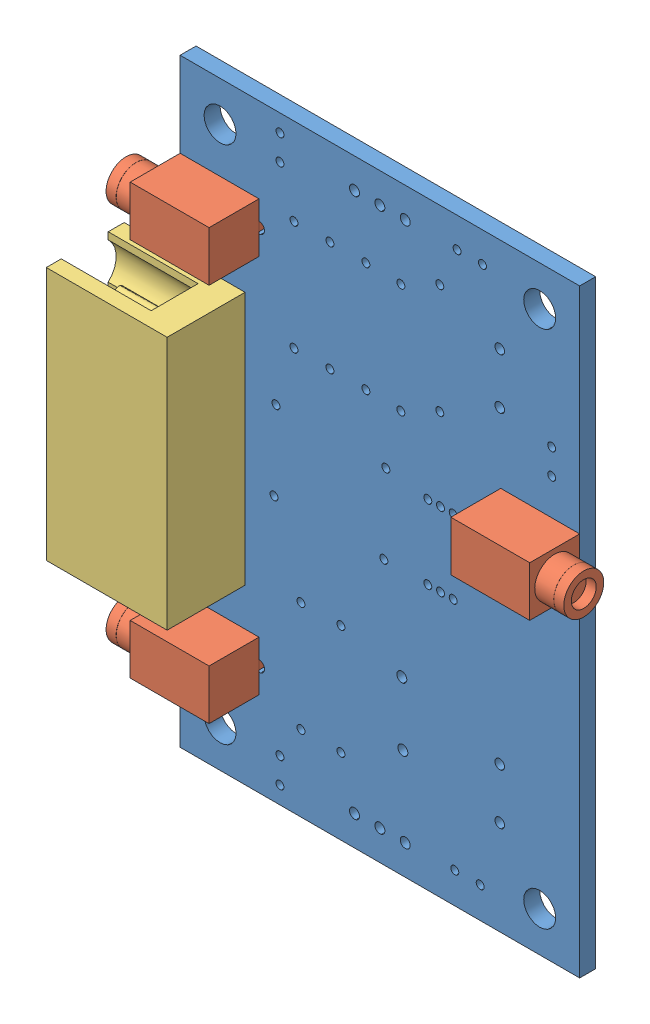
SolidWorks assembly Carte IR-GATE_B.SLDASM, configuration Défaut (file format 8000). Lengths in mm.
Overall size (48.51 60.01 10.81).
5 component instances, 3 part files, 50 mates.
Components (placement in the parent):
- PCB IR_GATE-1: PCB IR_GATE.SLDPRT [Défaut] at (-22.3945 -29.6859 59.1999) size (40.01 60.01 1.6)
- Embase jack 2.5-1: Embase jack 2.5.SLDPRT [Défaut] at (-22.3938 -18.6834 60.7999) x (1 0 0) z (0 -1 0) size (10.81 8.01 5)
- Embase jack 2.5-2: Embase jack 2.5.SLDPRT [Défaut] at (-22.3938 19.3238 60.7999) x (1 0 0) z (0 -1 0) size (10.81 8.01 5)
- V-TENM05 Connecteur male-1: V-TENM05 Connecteur male.SLDPRT [Défaut] at (-27.9925 13.0198 60.7999) x (0 -1 0) z (0 0 1) size (25.4 12.1 9.4)
- Embase jack 2.5-3: Embase jack 2.5.SLDPRT [Défaut] at (17.6112 6.3194 60.7999) x (-1 0 0) z (0 1 0) size (10.81 8.01 5)
Mates (geometry in assembly coordinates):
- Coïncidente1: coincident anti-aligned: axis of PCB IR_GATE-1 through (-18.8938 -18.6834 60.7999) axis (0 0 -1); axis of Embase jack 2.5-1 through (-18.8938 -18.6834 58.7999) axis (0 0 1)
- Coïncidente2: coincident anti-aligned: plane of PCB IR_GATE-1 through (-22.3945 -29.6859 60.7999) normal (0 0 1); plane of Embase jack 2.5-1 through (-22.3938 -21.1834 60.7999) normal (0 0 -1)
- Coïncidente4: coincident aligned: plane of PCB IR_GATE-1 through (-22.3945 -29.6859 60.7999) normal (-1 0 0); plane of Embase jack 2.5-1 through (-22.3938 -16.1834 65.7999) normal (-1 0 0)
- Coïncidente5: coincident anti-aligned: axis of PCB IR_GATE-1 through (-18.8938 19.3238 60.7999) axis (0 0 -1); axis of Embase jack 2.5-2 through (-18.8938 19.3238 58.7999) axis (0 0 1)
- Coïncidente6: coincident anti-aligned: plane of PCB IR_GATE-1 through (-22.3945 -29.6859 60.7999) normal (0 0 1); plane of Embase jack 2.5-2 through (-22.3938 16.8238 60.7999) normal (0 0 -1)
- Coïncidente7: coincident aligned: plane of PCB IR_GATE-1 through (-22.3945 -29.6859 60.7999) normal (-1 0 0); plane of Embase jack 2.5-2 through (-22.3938 21.8238 65.7999) normal (-1 0 0)
- Coïncidente10: coincident aligned: axis of PCB IR_GATE-1 through (-10.9931 10.6203 60.7999) axis (0 0 -1); axis of ? through (-10.9931 10.6203 61.1999) axis (0 0 -1)
- Coïncidente12: coincident aligned: plane of PCB IR_GATE-1 through (-22.3945 -29.6859 59.1999) normal (0 0 -1); plane of ? through (-10.9931 10.6203 59.1999) normal (0 0 -1)
- Coïncidente14: coincident aligned: axis of PCB IR_GATE-1 through (-7.3908 10.6203 60.7999) axis (0 0 -1); axis of ? through (-7.3908 10.6203 61.2266) axis (0 0 -1)
- Coïncidente16: coincident aligned: axis of PCB IR_GATE-1 through (-3.7911 21.6229 60.7999) axis (0 0 -1); axis of ? through (-3.7911 21.6229 61.1999) axis (0 0 -1)
- Coïncidente20: coincident aligned: axis of PCB IR_GATE-1 through (-0.2904 21.5213 60.7999) axis (0 0 -1); axis of ? through (-0.2904 21.5213 60.8861) axis (0 0 -1)
- Parallèle3: parallel aligned: axis of PCB IR_GATE-1 through (-0.2904 10.5213 60.7999) axis (0 0 -1); axis of ? through (-0.2904 10.5213 60.8861) axis (0 0 -1)
- Coïncidente22: coincident aligned: axis of PCB IR_GATE-1 through (-0.2904 10.5213 60.7999) axis (0 0 -1); axis of ? through (-0.2904 10.5213 60.8861) axis (0 0 -1)
- Parallèle4: parallel aligned: axis of PCB IR_GATE-1 through (-10.9931 21.6229 60.7999) axis (0 0 -1); axis of ? through (-10.9756 21.6203 61.1999) axis (0 0 -1)
- Coïncidente24: coincident aligned: plane of PCB IR_GATE-1 through (-22.3945 -29.6859 59.1999) normal (0 0 -1); plane of ? through (-3.7911 21.6229 59.1999) normal (0 0 -1)
- Coïncidente28: coincident aligned: axis of PCB IR_GATE-1 through (-12.7918 4.8206 60.7999) axis (0 0 -1); axis of ? through (-12.7918 4.8206 61.1999) axis (0 0 -1)
- Coïncidente29: coincident aligned: axis of PCB IR_GATE-1 through (-1.7918 4.8206 60.7999) axis (0 0 -1); axis of ? through (-1.7918 4.8206 61.1999) axis (0 0 -1)
- Coïncidente30: coincident aligned: axis of PCB IR_GATE-1 through (-12.9925 -3.1817 60.7999) axis (0 0 -1); axis of ? through (-12.9925 -3.1817 61.1999) axis (0 0 -1)
- Coïncidente31: coincident aligned: axis of PCB IR_GATE-1 through (-1.9925 -3.1817 60.7999) axis (0 0 -1); axis of ? through (-1.9925 -3.1817 61.1999) axis (0 0 -1)
- Coïncidente32: coincident aligned: plane of PCB IR_GATE-1 through (-22.3945 -29.6859 59.1999) normal (0 0 -1); plane of ? through (-12.7918 4.8206 59.1999) normal (0 0 -1)
- Coïncidente33: coincident aligned: plane of PCB IR_GATE-1 through (-22.3945 -29.6859 59.1999) normal (0 0 -1); plane of ? through (-12.9925 -3.1817 59.1999) normal (0 0 -1)
- Coïncidente34: coincident: axis of PCB IR_GATE-1 through (-10.292 -11.0824 60.7999) axis (0 0 -1); axis of ? through (-10.292 -11.0824 61.1999) axis (0 0 -1)
- Coïncidente36: coincident aligned: axis of PCB IR_GATE-1 through (-6.2908 -11.0824 60.7999) axis (0 0 -1); axis of ? through (-6.2908 -11.0824 61.1999) axis (0 0 -1)
- Coïncidente38: coincident aligned: plane of PCB IR_GATE-1 through (-22.3945 -29.6859 59.1999) normal (0 0 -1); plane of ? through (-10.2814 -22.0824 59.1999) normal (0 0 -1)
- Coïncidente39: coincident aligned: plane of PCB IR_GATE-1 through (-22.3945 -29.6859 59.1999) normal (0 0 -1); plane of ? through (-6.2793 -22.0824 59.1999) normal (0 0 -1)
- Parallèle11: parallel aligned: plane of PCB IR_GATE-1 through (-22.3945 30.3238 60.7999) normal (0 1 0); plane of ? through (0.5866 29.735 64.0999) normal (0 1 0)
- Parallèle12: parallel aligned: plane of PCB IR_GATE-1 through (17.6119 -29.6859 60.7999) normal (0 -1 0); plane of ? through (-5.4084 -29.0801 62.4999) normal (0 -1 0)
- Coïncidente44: coincident aligned: plane of PCB IR_GATE-1 through (-22.3945 -29.6859 59.1999) normal (0 0 -1); plane of ? through (-4.1084 -26.8801 59.1999) normal (0 0 -1)
- Coïncidente46: coincident anti-aligned: axis of PCB IR_GATE-1 through (4.9505 4.2185 60.7999) axis (0 0 -1); axis of ? through (4.9503 4.2185 59.1999) axis (0 0 1)
- Coïncidente47: coincident anti-aligned: axis of PCB IR_GATE-1 through (3.6803 4.2185 60.7999) axis (0 0 -1); axis of ? through (3.6803 4.2185 59.1999) axis (0 0 1)
- Coïncidente48: coincident aligned: plane of PCB IR_GATE-1 through (-22.3945 -29.6859 59.1999) normal (0 0 -1); plane of ? through (4.9503 4.2185 59.1999) normal (0 0 -1)
- Coïncidente49: coincident aligned: axis of PCB IR_GATE-1 through (9.6096 20.8633 60.7999) axis (0 0 -1); axis of ? through (9.6096 20.8625 60.6999) axis (0 0 -1)
- Coïncidente50: coincident aligned: axis of PCB IR_GATE-1 through (9.6096 15.7825 60.7999) axis (0 0 -1); axis of ? through (9.6096 15.7825 60.6999) axis (0 0 -1)
- Coïncidente52: coincident aligned: axis of PCB IR_GATE-1 through (9.6096 -15.1446 60.7999) axis (0 0 -1); axis of ? through (9.6096 -15.1454 60.6999) axis (0 0 -1)
- Coïncidente53: coincident aligned: axis of PCB IR_GATE-1 through (9.6096 -20.2254 60.7999) axis (0 0 -1); axis of ? through (9.6096 -20.2254 60.6999) axis (0 0 -1)
- Coïncidente54: coincident aligned: plane of PCB IR_GATE-1 through (-22.3945 -29.6859 59.1999) normal (0 0 -1); plane of ? through (9.6096 -20.2254 59.1999) normal (0 0 -1)
- Coïncidente56: coincident aligned: plane of PCB IR_GATE-1 through (-22.3945 -29.6859 59.1999) normal (0 0 -1); plane of ? through (9.6096 15.7825 59.1999) normal (0 0 -1)
- Coïncidente57: coincident anti-aligned: axis of PCB IR_GATE-1 through (-12.3929 -27.9559 60.7999) axis (0 0 -1); axis of ? through (-12.3929 -27.9555 58.7999) axis (0 0 1)
- Coïncidente58: coincident anti-aligned: axis of PCB IR_GATE-1 through (-12.3929 -25.4155 60.7999) axis (0 0 -1); axis of ? through (-12.3929 -25.4155 58.7999) axis (0 0 1)
- Coïncidente59: coincident anti-aligned: plane of PCB IR_GATE-1 through (-22.3945 -29.6859 60.7999) normal (0 0 1); circle of ?
- Coïncidente63: coincident anti-aligned: axis of PCB IR_GATE-1 through (-12.3929 26.0534 60.7999) axis (0 0 -1); axis of ? through (-12.3929 26.0538 58.7999) axis (0 0 1)
- Coïncidente64: coincident anti-aligned: axis of PCB IR_GATE-1 through (-12.3929 28.5938 60.7999) axis (0 0 -1); axis of ? through (-12.3929 28.5938 58.7999) axis (0 0 1)
- Coïncidente65: coincident anti-aligned: plane of PCB IR_GATE-1 through (-22.3945 -29.6859 60.7999) normal (0 0 1); circle of ?
- Coïncidente66: coincident anti-aligned: axis of PCB IR_GATE-1 through (-17.3925 10.4806 60.7999) axis (0 0 -1); axis of V-TENM05 Connecteur male-1 through (-17.3925 10.4798 59.1999) axis (0 0 1)
- Coïncidente67: coincident anti-aligned: axis of PCB IR_GATE-1 through (-17.3925 5.3998 60.7999) axis (0 0 -1); axis of V-TENM05 Connecteur male-1 through (-17.3925 5.3998 59.1999) axis (0 0 1)
- Coïncidente68: coincident anti-aligned: plane of PCB IR_GATE-1 through (-22.3945 -29.6859 60.7999) normal (0 0 1); plane of V-TENM05 Connecteur male-1 through (-27.9925 13.0198 60.7999) normal (0 0 -1)
- Coïncidente69: coincident anti-aligned: plane of PCB IR_GATE-1 through (-22.3945 -29.6859 60.7999) normal (0 0 1); plane of ? through (-0.7134 27.535 60.7999) normal (0 0 -1)
- Coïncidente70: coincident: axis of PCB IR_GATE-1 through (14.1112 6.3194 60.7999) axis (0 0 -1); axis of Embase jack 2.5-3 through (14.1112 6.3194 58.7999) axis (0 0 1)
- Coïncidente71: coincident: plane of PCB IR_GATE-1 through (17.6119 30.3238 60.7999) normal (1 0 0); plane of Embase jack 2.5-3 through (17.6112 3.8194 65.7999) normal (1 0 0)
- Coïncidente72: coincident anti-aligned: plane of PCB IR_GATE-1 through (-22.3945 -29.6859 60.7999) normal (0 0 1); plane of Embase jack 2.5-3 through (17.6112 8.8194 60.7999) normal (0 0 -1)
